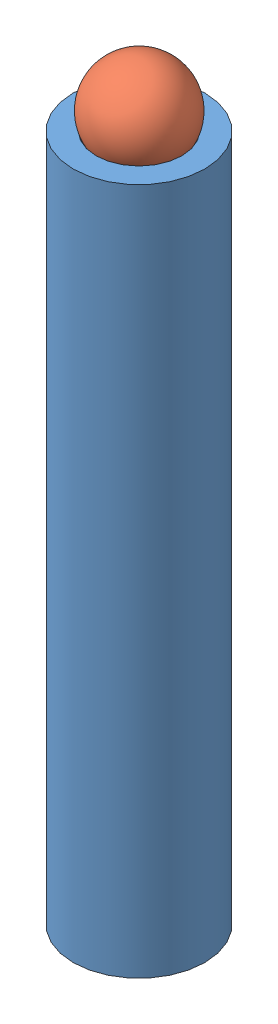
SolidWorks assembly Assem1.sldasm, configuration Default (file format 11000). Lengths in mm.
Overall size (5.75 34.23 6.33).
2 component instances, 2 part files, 0 mates.
Components (placement in the parent):
- tube-1: tube.SLDPRT [Default] at (10.6757 1.2886 33.064) size (5.75 30 5.75)
- bead-1: bead.SLDPRT [Default] at (10.6885 32.0627 33.0674) x (0.745384 0.578052 0.332052) z (0.017809 -0.515191 0.856891) size (4 4 4)
